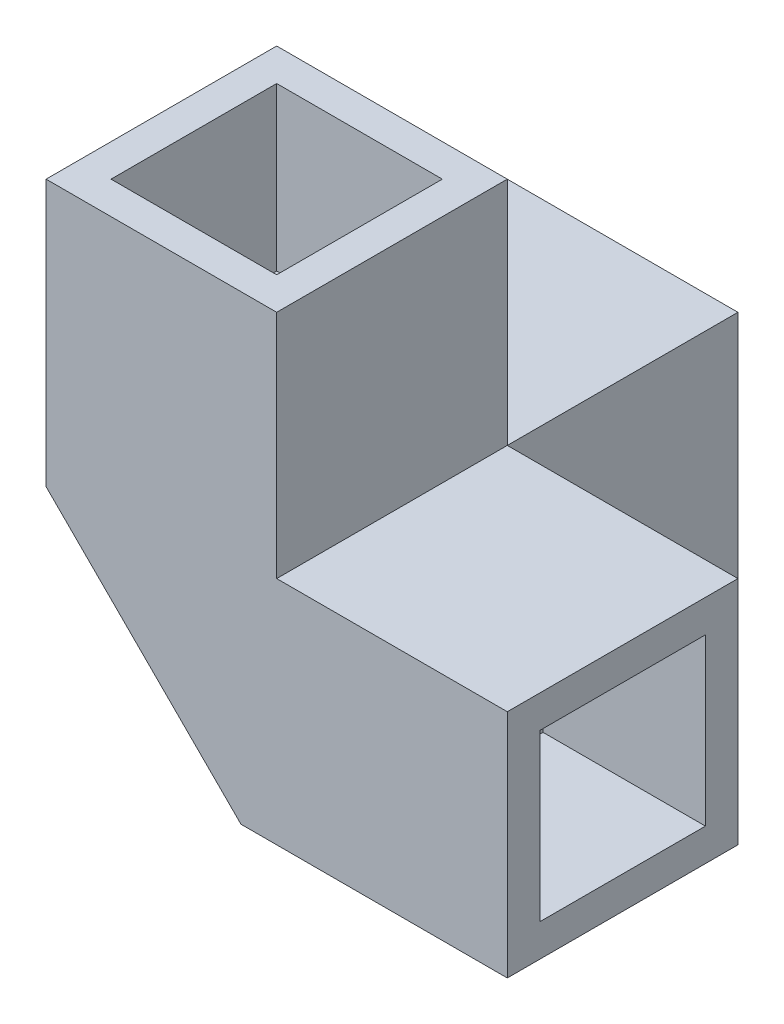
ISO-10303-21;
HEADER;
FILE_DESCRIPTION(('STEP AP214'),'2;1');
FILE_NAME('part.step','',(''),(''),'','','');
FILE_SCHEMA(('AUTOMOTIVE_DESIGN { 1 0 10303 214 1 1 1 1 }'));
ENDSEC;
DATA;
#1=APPLICATION_CONTEXT('core data for automotive mechanical design processes');
#2=APPLICATION_PROTOCOL_DEFINITION('international standard','automotive_design',2000,#1);
#3=PRODUCT_CONTEXT('',#1,'mechanical');
#4=PRODUCT('Part','Part','',(#3));
#5=PRODUCT_RELATED_PRODUCT_CATEGORY('part','',(#4));
#6=PRODUCT_DEFINITION_FORMATION('','',#4);
#7=PRODUCT_DEFINITION_CONTEXT('part definition',#1,'design');
#8=PRODUCT_DEFINITION('design','',#6,#7);
#9=PRODUCT_DEFINITION_SHAPE('','',#8);
#10=(LENGTH_UNIT() NAMED_UNIT(*) SI_UNIT(.MILLI.,.METRE.));
#11=(NAMED_UNIT(*) PLANE_ANGLE_UNIT() SI_UNIT($,.RADIAN.));
#12=(NAMED_UNIT(*) SI_UNIT($,.STERADIAN.) SOLID_ANGLE_UNIT());
#13=UNCERTAINTY_MEASURE_WITH_UNIT(LENGTH_MEASURE(1.E-05),#10,'distance_accuracy_value','');
#14=(GEOMETRIC_REPRESENTATION_CONTEXT(3) GLOBAL_UNCERTAINTY_ASSIGNED_CONTEXT((#13)) GLOBAL_UNIT_ASSIGNED_CONTEXT((#10,
#11,#12)) REPRESENTATION_CONTEXT('',''));
#15=CARTESIAN_POINT('',(0.,0.,0.));
#16=DIRECTION('',(0.,0.,1.));
#17=DIRECTION('',(1.,0.,0.));
#18=AXIS2_PLACEMENT_3D('',#15,#16,#17);
#19=CARTESIAN_POINT('',(0.,0.,0.));
#20=DIRECTION('',(0.,-1.,0.));
#21=DIRECTION('',(0.,0.,-1.));
#22=AXIS2_PLACEMENT_3D('',#19,#20,#21);
#23=PLANE('',#22);
#24=DIRECTION('',(1.,0.,0.));
#25=VECTOR('',#24,1.);
#26=CARTESIAN_POINT('',(53.25,0.,17.75));
#27=LINE('',#26,#25);
#28=CARTESIAN_POINT('',(12.25,0.,17.75));
#29=VERTEX_POINT('',#28);
#30=CARTESIAN_POINT('',(53.25,0.,17.75));
#31=VERTEX_POINT('',#30);
#32=EDGE_CURVE('E195',#29,#31,#27,.T.);
#33=ORIENTED_EDGE('',*,*,#32,.F.);
#34=DIRECTION('',(-0.707106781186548,0.,-0.707106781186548));
#35=VECTOR('',#34,1.);
#36=CARTESIAN_POINT('',(-2.75,0.,2.75));
#37=LINE('',#36,#35);
#38=CARTESIAN_POINT('',(-17.75,0.,-12.25));
#39=VERTEX_POINT('',#38);
#40=EDGE_CURVE('E11',#29,#39,#37,.T.);
#41=ORIENTED_EDGE('',*,*,#40,.T.);
#42=DIRECTION('',(0.,0.,1.));
#43=VECTOR('',#42,1.);
#44=CARTESIAN_POINT('',(-17.75,0.,17.75));
#45=LINE('',#44,#43);
#46=CARTESIAN_POINT('',(-17.75,0.,-53.25));
#47=VERTEX_POINT('',#46);
#48=EDGE_CURVE('E204',#47,#39,#45,.T.);
#49=ORIENTED_EDGE('',*,*,#48,.F.);
#50=DIRECTION('',(-1.,0.,0.));
#51=VECTOR('',#50,1.);
#52=CARTESIAN_POINT('',(-17.75,0.,-53.25));
#53=LINE('',#52,#51);
#54=CARTESIAN_POINT('',(17.75,0.,-53.25));
#55=VERTEX_POINT('',#54);
#56=EDGE_CURVE('E210',#55,#47,#53,.T.);
#57=ORIENTED_EDGE('',*,*,#56,.F.);
#58=DIRECTION('',(0.,0.,-1.));
#59=VECTOR('',#58,1.);
#60=CARTESIAN_POINT('',(17.75,0.,-53.25));
#61=LINE('',#60,#59);
#62=CARTESIAN_POINT('',(17.75,0.,-17.75));
#63=VERTEX_POINT('',#62);
#64=EDGE_CURVE('E265',#63,#55,#61,.T.);
#65=ORIENTED_EDGE('',*,*,#64,.F.);
#66=DIRECTION('',(-1.,0.,0.));
#67=VECTOR('',#66,1.);
#68=CARTESIAN_POINT('',(17.75,0.,-17.75));
#69=LINE('',#68,#67);
#70=CARTESIAN_POINT('',(53.25,0.,-17.75));
#71=VERTEX_POINT('',#70);
#72=EDGE_CURVE('E261',#71,#63,#69,.T.);
#73=ORIENTED_EDGE('',*,*,#72,.F.);
#74=DIRECTION('',(0.,0.,-1.));
#75=VECTOR('',#74,1.);
#76=CARTESIAN_POINT('',(53.25,0.,-17.75));
#77=LINE('',#76,#75);
#78=EDGE_CURVE('E202',#31,#71,#77,.T.);
#79=ORIENTED_EDGE('',*,*,#78,.F.);
#80=EDGE_LOOP('',(#33,#41,#49,#57,#65,#73,#79));
#81=FACE_BOUND('',#80,.T.);
#82=ADVANCED_FACE('F43',(#81),#23,.T.);
#83=CARTESIAN_POINT('',(0.,35.5,0.));
#84=DIRECTION('',(0.,-1.,0.));
#85=DIRECTION('',(0.,0.,-1.));
#86=AXIS2_PLACEMENT_3D('',#83,#84,#85);
#87=PLANE('',#86);
#88=DIRECTION('',(0.,0.,-1.));
#89=VECTOR('',#88,1.);
#90=CARTESIAN_POINT('',(17.75,35.5,17.75));
#91=LINE('',#90,#89);
#92=CARTESIAN_POINT('',(17.75,35.5,17.75));
#93=VERTEX_POINT('',#92);
#94=CARTESIAN_POINT('',(17.75,35.5,-17.75));
#95=VERTEX_POINT('',#94);
#96=EDGE_CURVE('E294',#93,#95,#91,.T.);
#97=ORIENTED_EDGE('',*,*,#96,.F.);
#98=DIRECTION('',(1.,0.,0.));
#99=VECTOR('',#98,1.);
#100=CARTESIAN_POINT('',(-17.75,35.5,17.75));
#101=LINE('',#100,#99);
#102=CARTESIAN_POINT('',(53.25,35.5,17.75));
#103=VERTEX_POINT('',#102);
#104=EDGE_CURVE('E239',#93,#103,#101,.T.);
#105=ORIENTED_EDGE('',*,*,#104,.T.);
#106=DIRECTION('',(0.,0.,-1.));
#107=VECTOR('',#106,1.);
#108=CARTESIAN_POINT('',(53.25,35.5,-17.75));
#109=LINE('',#108,#107);
#110=CARTESIAN_POINT('',(53.25,35.5,-17.75));
#111=VERTEX_POINT('',#110);
#112=EDGE_CURVE('E219',#103,#111,#109,.T.);
#113=ORIENTED_EDGE('',*,*,#112,.T.);
#114=DIRECTION('',(-1.,0.,0.));
#115=VECTOR('',#114,1.);
#116=CARTESIAN_POINT('',(17.75,35.5,-17.75));
#117=LINE('',#116,#115);
#118=EDGE_CURVE('E208',#111,#95,#117,.T.);
#119=ORIENTED_EDGE('',*,*,#118,.T.);
#120=EDGE_LOOP('',(#97,#105,#113,#119));
#121=FACE_BOUND('',#120,.T.);
#122=ADVANCED_FACE('F475',(#121),#87,.F.);
#123=DIRECTION('',(-1.,0.,0.));
#124=VECTOR('',#123,1.);
#125=CARTESIAN_POINT('',(-17.75,35.5,-17.75));
#126=LINE('',#125,#124);
#127=CARTESIAN_POINT('',(-17.75,35.5,-17.75));
#128=VERTEX_POINT('',#127);
#129=EDGE_CURVE('E285',#95,#128,#126,.T.);
#130=ORIENTED_EDGE('',*,*,#129,.F.);
#131=DIRECTION('',(0.,0.,-1.));
#132=VECTOR('',#131,1.);
#133=CARTESIAN_POINT('',(17.75,35.5,-53.25));
#134=LINE('',#133,#132);
#135=CARTESIAN_POINT('',(17.75,35.5,-53.25));
#136=VERTEX_POINT('',#135);
#137=EDGE_CURVE('E248',#95,#136,#134,.T.);
#138=ORIENTED_EDGE('',*,*,#137,.T.);
#139=DIRECTION('',(-1.,0.,0.));
#140=VECTOR('',#139,1.);
#141=CARTESIAN_POINT('',(-17.75,35.5,-53.25));
#142=LINE('',#141,#140);
#143=CARTESIAN_POINT('',(-17.75,35.5,-53.25));
#144=VERTEX_POINT('',#143);
#145=EDGE_CURVE('E245',#136,#144,#142,.T.);
#146=ORIENTED_EDGE('',*,*,#145,.T.);
#147=DIRECTION('',(0.,0.,1.));
#148=VECTOR('',#147,1.);
#149=CARTESIAN_POINT('',(-17.75,35.5,-17.75));
#150=LINE('',#149,#148);
#151=EDGE_CURVE('E242',#144,#128,#150,.T.);
#152=ORIENTED_EDGE('',*,*,#151,.T.);
#153=EDGE_LOOP('',(#130,#138,#146,#152));
#154=FACE_BOUND('',#153,.T.);
#155=ADVANCED_FACE('F284',(#154),#87,.F.);
#156=CARTESIAN_POINT('',(17.75,35.5,-17.75));
#157=DIRECTION('',(0.,0.,1.));
#158=DIRECTION('',(1.,0.,0.));
#159=AXIS2_PLACEMENT_3D('',#156,#157,#158);
#160=PLANE('',#159);
#161=ORIENTED_EDGE('',*,*,#72,.T.);
#162=DIRECTION('',(0.,-1.,0.));
#163=VECTOR('',#162,1.);
#164=CARTESIAN_POINT('',(17.75,35.5,-17.75));
#165=LINE('',#164,#163);
#166=EDGE_CURVE('E232',#95,#63,#165,.T.);
#167=ORIENTED_EDGE('',*,*,#166,.F.);
#168=ORIENTED_EDGE('',*,*,#118,.F.);
#169=DIRECTION('',(0.,-1.,0.));
#170=VECTOR('',#169,1.);
#171=CARTESIAN_POINT('',(53.25,35.5,-17.75));
#172=LINE('',#171,#170);
#173=EDGE_CURVE('E214',#111,#71,#172,.T.);
#174=ORIENTED_EDGE('',*,*,#173,.T.);
#175=EDGE_LOOP('',(#161,#167,#168,#174));
#176=FACE_BOUND('',#175,.T.);
#177=ADVANCED_FACE('F45',(#176),#160,.F.);
#178=CARTESIAN_POINT('',(17.75,35.5,-53.25));
#179=DIRECTION('',(-1.,0.,0.));
#180=DIRECTION('',(0.,0.,1.));
#181=AXIS2_PLACEMENT_3D('',#178,#179,#180);
#182=PLANE('',#181);
#183=ORIENTED_EDGE('',*,*,#64,.T.);
#184=DIRECTION('',(0.,-1.,0.));
#185=VECTOR('',#184,1.);
#186=CARTESIAN_POINT('',(17.75,35.5,-53.25));
#187=LINE('',#186,#185);
#188=EDGE_CURVE('E228',#136,#55,#187,.T.);
#189=ORIENTED_EDGE('',*,*,#188,.F.);
#190=ORIENTED_EDGE('',*,*,#137,.F.);
#191=ORIENTED_EDGE('',*,*,#166,.T.);
#192=EDGE_LOOP('',(#183,#189,#190,#191));
#193=FACE_BOUND('',#192,.T.);
#194=ADVANCED_FACE('F466',(#193),#182,.F.);
#195=CARTESIAN_POINT('',(-17.75,35.5,-53.25));
#196=DIRECTION('',(0.,0.,1.));
#197=DIRECTION('',(1.,0.,0.));
#198=AXIS2_PLACEMENT_3D('',#195,#196,#197);
#199=PLANE('',#198);
#200=DIRECTION('',(-1.,0.,0.));
#201=VECTOR('',#200,1.);
#202=CARTESIAN_POINT('',(12.75,5.,-53.25));
#203=LINE('',#202,#201);
#204=CARTESIAN_POINT('',(12.75,5.,-53.25));
#205=VERTEX_POINT('',#204);
#206=CARTESIAN_POINT('',(-12.75,5.,-53.25));
#207=VERTEX_POINT('',#206);
#208=EDGE_CURVE('E429',#205,#207,#203,.T.);
#209=ORIENTED_EDGE('',*,*,#208,.F.);
#210=DIRECTION('',(0.,-1.,0.));
#211=VECTOR('',#210,1.);
#212=CARTESIAN_POINT('',(12.75,30.5,-53.25));
#213=LINE('',#212,#211);
#214=CARTESIAN_POINT('',(12.75,30.5,-53.25));
#215=VERTEX_POINT('',#214);
#216=EDGE_CURVE('E66',#215,#205,#213,.T.);
#217=ORIENTED_EDGE('',*,*,#216,.F.);
#218=DIRECTION('',(1.,0.,0.));
#219=VECTOR('',#218,1.);
#220=CARTESIAN_POINT('',(-12.75,30.5,-53.25));
#221=LINE('',#220,#219);
#222=CARTESIAN_POINT('',(-12.75,30.5,-53.25));
#223=VERTEX_POINT('',#222);
#224=EDGE_CURVE('E420',#223,#215,#221,.T.);
#225=ORIENTED_EDGE('',*,*,#224,.F.);
#226=DIRECTION('',(0.,1.,0.));
#227=VECTOR('',#226,1.);
#228=CARTESIAN_POINT('',(-12.75,5.,-53.25));
#229=LINE('',#228,#227);
#230=EDGE_CURVE('E425',#207,#223,#229,.T.);
#231=ORIENTED_EDGE('',*,*,#230,.F.);
#232=EDGE_LOOP('',(#209,#217,#225,#231));
#233=FACE_BOUND('',#232,.T.);
#234=ORIENTED_EDGE('',*,*,#56,.T.);
#235=DIRECTION('',(0.,-1.,0.));
#236=VECTOR('',#235,1.);
#237=CARTESIAN_POINT('',(-17.75,35.5,-53.25));
#238=LINE('',#237,#236);
#239=EDGE_CURVE('E224',#144,#47,#238,.T.);
#240=ORIENTED_EDGE('',*,*,#239,.F.);
#241=ORIENTED_EDGE('',*,*,#145,.F.);
#242=ORIENTED_EDGE('',*,*,#188,.T.);
#243=EDGE_LOOP('',(#234,#240,#241,#242));
#244=FACE_BOUND('',#243,.T.);
#245=ADVANCED_FACE('F272',(#233,#244),#199,.F.);
#246=CARTESIAN_POINT('',(-17.75,35.5,17.75));
#247=DIRECTION('',(1.,0.,0.));
#248=DIRECTION('',(0.,0.,-1.));
#249=AXIS2_PLACEMENT_3D('',#246,#247,#248);
#250=PLANE('',#249);
#251=DIRECTION('',(0.,-0.707106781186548,-0.707106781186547));
#252=VECTOR('',#251,1.);
#253=CARTESIAN_POINT('',(-17.75,32.75,20.5));
#254=LINE('',#253,#252);
#255=CARTESIAN_POINT('',(-17.75,30.,17.75));
#256=VERTEX_POINT('',#255);
#257=EDGE_CURVE('E59',#256,#39,#254,.T.);
#258=ORIENTED_EDGE('',*,*,#257,.F.);
#259=DIRECTION('',(0.,-1.,0.));
#260=VECTOR('',#259,1.);
#261=CARTESIAN_POINT('',(-17.75,35.5,17.75));
#262=LINE('',#261,#260);
#263=CARTESIAN_POINT('',(-17.75,71.,17.75));
#264=VERTEX_POINT('',#263);
#265=EDGE_CURVE('E198',#264,#256,#262,.T.);
#266=ORIENTED_EDGE('',*,*,#265,.F.);
#267=DIRECTION('',(0.,0.,1.));
#268=VECTOR('',#267,1.);
#269=CARTESIAN_POINT('',(-17.75,71.,17.75));
#270=LINE('',#269,#268);
#271=CARTESIAN_POINT('',(-17.75,71.,-17.75));
#272=VERTEX_POINT('',#271);
#273=EDGE_CURVE('E313',#272,#264,#270,.T.);
#274=ORIENTED_EDGE('',*,*,#273,.F.);
#275=DIRECTION('',(0.,-1.,0.));
#276=VECTOR('',#275,1.);
#277=CARTESIAN_POINT('',(-17.75,71.,-17.75));
#278=LINE('',#277,#276);
#279=EDGE_CURVE('E281',#272,#128,#278,.T.);
#280=ORIENTED_EDGE('',*,*,#279,.T.);
#281=ORIENTED_EDGE('',*,*,#151,.F.);
#282=ORIENTED_EDGE('',*,*,#239,.T.);
#283=ORIENTED_EDGE('',*,*,#48,.T.);
#284=EDGE_LOOP('',(#258,#266,#274,#280,#281,#282,#283));
#285=FACE_BOUND('',#284,.T.);
#286=ADVANCED_FACE('F277',(#285),#250,.F.);
#287=CARTESIAN_POINT('',(53.25,35.5,17.75));
#288=DIRECTION('',(0.,0.,-1.));
#289=DIRECTION('',(-1.,0.,0.));
#290=AXIS2_PLACEMENT_3D('',#287,#288,#289);
#291=PLANE('',#290);
#292=DIRECTION('',(-0.707106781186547,0.707106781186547,0.));
#293=VECTOR('',#292,1.);
#294=CARTESIAN_POINT('',(15.,-2.74999999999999,17.75));
#295=LINE('',#294,#293);
#296=EDGE_CURVE('E52',#29,#256,#295,.T.);
#297=ORIENTED_EDGE('',*,*,#296,.F.);
#298=ORIENTED_EDGE('',*,*,#32,.T.);
#299=DIRECTION('',(0.,-1.,0.));
#300=VECTOR('',#299,1.);
#301=CARTESIAN_POINT('',(53.25,35.5,17.75));
#302=LINE('',#301,#300);
#303=EDGE_CURVE('E218',#103,#31,#302,.T.);
#304=ORIENTED_EDGE('',*,*,#303,.F.);
#305=ORIENTED_EDGE('',*,*,#104,.F.);
#306=DIRECTION('',(0.,-1.,0.));
#307=VECTOR('',#306,1.);
#308=CARTESIAN_POINT('',(17.75,71.,17.75));
#309=LINE('',#308,#307);
#310=CARTESIAN_POINT('',(17.75,71.,17.75));
#311=VERTEX_POINT('',#310);
#312=EDGE_CURVE('E305',#311,#93,#309,.T.);
#313=ORIENTED_EDGE('',*,*,#312,.F.);
#314=DIRECTION('',(1.,0.,0.));
#315=VECTOR('',#314,1.);
#316=CARTESIAN_POINT('',(-17.75,71.,17.75));
#317=LINE('',#316,#315);
#318=EDGE_CURVE('E308',#264,#311,#317,.T.);
#319=ORIENTED_EDGE('',*,*,#318,.F.);
#320=ORIENTED_EDGE('',*,*,#265,.T.);
#321=EDGE_LOOP('',(#297,#298,#304,#305,#313,#319,#320));
#322=FACE_BOUND('',#321,.T.);
#323=ADVANCED_FACE('F193',(#322),#291,.F.);
#324=CARTESIAN_POINT('',(53.25,35.5,-17.75));
#325=DIRECTION('',(-1.,0.,0.));
#326=DIRECTION('',(0.,0.,1.));
#327=AXIS2_PLACEMENT_3D('',#324,#325,#326);
#328=PLANE('',#327);
#329=DIRECTION('',(0.,0.,-1.));
#330=VECTOR('',#329,1.);
#331=CARTESIAN_POINT('',(53.25,5.,12.75));
#332=LINE('',#331,#330);
#333=CARTESIAN_POINT('',(53.25,5.,12.75));
#334=VERTEX_POINT('',#333);
#335=CARTESIAN_POINT('',(53.25,5.,-12.75));
#336=VERTEX_POINT('',#335);
#337=EDGE_CURVE('E342',#334,#336,#332,.T.);
#338=ORIENTED_EDGE('',*,*,#337,.F.);
#339=DIRECTION('',(0.,-1.,0.));
#340=VECTOR('',#339,1.);
#341=CARTESIAN_POINT('',(53.25,30.5,12.75));
#342=LINE('',#341,#340);
#343=CARTESIAN_POINT('',(53.25,30.5,12.75));
#344=VERTEX_POINT('',#343);
#345=EDGE_CURVE('E346',#344,#334,#342,.T.);
#346=ORIENTED_EDGE('',*,*,#345,.F.);
#347=DIRECTION('',(0.,0.,1.));
#348=VECTOR('',#347,1.);
#349=CARTESIAN_POINT('',(53.25,30.5,-12.75));
#350=LINE('',#349,#348);
#351=CARTESIAN_POINT('',(53.25,30.5,-12.75));
#352=VERTEX_POINT('',#351);
#353=EDGE_CURVE('E333',#352,#344,#350,.T.);
#354=ORIENTED_EDGE('',*,*,#353,.F.);
#355=DIRECTION('',(0.,1.,0.));
#356=VECTOR('',#355,1.);
#357=CARTESIAN_POINT('',(53.25,5.,-12.75));
#358=LINE('',#357,#356);
#359=EDGE_CURVE('E338',#336,#352,#358,.T.);
#360=ORIENTED_EDGE('',*,*,#359,.F.);
#361=EDGE_LOOP('',(#338,#346,#354,#360));
#362=FACE_BOUND('',#361,.T.);
#363=ORIENTED_EDGE('',*,*,#78,.T.);
#364=ORIENTED_EDGE('',*,*,#173,.F.);
#365=ORIENTED_EDGE('',*,*,#112,.F.);
#366=ORIENTED_EDGE('',*,*,#303,.T.);
#367=EDGE_LOOP('',(#363,#364,#365,#366));
#368=FACE_BOUND('',#367,.T.);
#369=ADVANCED_FACE('F483',(#362,#368),#328,.F.);
#370=CARTESIAN_POINT('',(17.75,71.,17.75));
#371=DIRECTION('',(-1.,0.,0.));
#372=DIRECTION('',(0.,0.,1.));
#373=AXIS2_PLACEMENT_3D('',#370,#371,#372);
#374=PLANE('',#373);
#375=ORIENTED_EDGE('',*,*,#96,.T.);
#376=DIRECTION('',(0.,-1.,0.));
#377=VECTOR('',#376,1.);
#378=CARTESIAN_POINT('',(17.75,71.,-17.75));
#379=LINE('',#378,#377);
#380=CARTESIAN_POINT('',(17.75,71.,-17.75));
#381=VERTEX_POINT('',#380);
#382=EDGE_CURVE('E258',#381,#95,#379,.T.);
#383=ORIENTED_EDGE('',*,*,#382,.F.);
#384=DIRECTION('',(0.,0.,-1.));
#385=VECTOR('',#384,1.);
#386=CARTESIAN_POINT('',(17.75,71.,17.75));
#387=LINE('',#386,#385);
#388=EDGE_CURVE('E293',#311,#381,#387,.T.);
#389=ORIENTED_EDGE('',*,*,#388,.F.);
#390=ORIENTED_EDGE('',*,*,#312,.T.);
#391=EDGE_LOOP('',(#375,#383,#389,#390));
#392=FACE_BOUND('',#391,.T.);
#393=ADVANCED_FACE('F486',(#392),#374,.F.);
#394=CARTESIAN_POINT('',(-17.75,71.,-17.75));
#395=DIRECTION('',(0.,0.,1.));
#396=DIRECTION('',(1.,0.,0.));
#397=AXIS2_PLACEMENT_3D('',#394,#395,#396);
#398=PLANE('',#397);
#399=ORIENTED_EDGE('',*,*,#129,.T.);
#400=ORIENTED_EDGE('',*,*,#279,.F.);
#401=DIRECTION('',(-1.,0.,0.));
#402=VECTOR('',#401,1.);
#403=CARTESIAN_POINT('',(-17.75,71.,-17.75));
#404=LINE('',#403,#402);
#405=EDGE_CURVE('E299',#381,#272,#404,.T.);
#406=ORIENTED_EDGE('',*,*,#405,.F.);
#407=ORIENTED_EDGE('',*,*,#382,.T.);
#408=EDGE_LOOP('',(#399,#400,#406,#407));
#409=FACE_BOUND('',#408,.T.);
#410=ADVANCED_FACE('F289',(#409),#398,.F.);
#411=CARTESIAN_POINT('',(0.,71.,0.));
#412=DIRECTION('',(0.,-1.,0.));
#413=DIRECTION('',(0.,0.,-1.));
#414=AXIS2_PLACEMENT_3D('',#411,#412,#413);
#415=PLANE('',#414);
#416=DIRECTION('',(0.,0.,-1.));
#417=VECTOR('',#416,1.);
#418=CARTESIAN_POINT('',(12.75,71.,12.75));
#419=LINE('',#418,#417);
#420=CARTESIAN_POINT('',(12.75,71.,12.75));
#421=VERTEX_POINT('',#420);
#422=CARTESIAN_POINT('',(12.75,71.,-12.75));
#423=VERTEX_POINT('',#422);
#424=EDGE_CURVE('E386',#421,#423,#419,.T.);
#425=ORIENTED_EDGE('',*,*,#424,.F.);
#426=DIRECTION('',(1.,0.,0.));
#427=VECTOR('',#426,1.);
#428=CARTESIAN_POINT('',(-12.75,71.,12.75));
#429=LINE('',#428,#427);
#430=CARTESIAN_POINT('',(-12.75,71.,12.75));
#431=VERTEX_POINT('',#430);
#432=EDGE_CURVE('E390',#431,#421,#429,.T.);
#433=ORIENTED_EDGE('',*,*,#432,.F.);
#434=DIRECTION('',(0.,0.,1.));
#435=VECTOR('',#434,1.);
#436=CARTESIAN_POINT('',(-12.75,71.,-12.75));
#437=LINE('',#436,#435);
#438=CARTESIAN_POINT('',(-12.75,71.,-12.75));
#439=VERTEX_POINT('',#438);
#440=EDGE_CURVE('E377',#439,#431,#437,.T.);
#441=ORIENTED_EDGE('',*,*,#440,.F.);
#442=DIRECTION('',(-1.,0.,0.));
#443=VECTOR('',#442,1.);
#444=CARTESIAN_POINT('',(12.75,71.,-12.75));
#445=LINE('',#444,#443);
#446=EDGE_CURVE('E382',#423,#439,#445,.T.);
#447=ORIENTED_EDGE('',*,*,#446,.F.);
#448=EDGE_LOOP('',(#425,#433,#441,#447));
#449=FACE_BOUND('',#448,.T.);
#450=ORIENTED_EDGE('',*,*,#388,.T.);
#451=ORIENTED_EDGE('',*,*,#405,.T.);
#452=ORIENTED_EDGE('',*,*,#273,.T.);
#453=ORIENTED_EDGE('',*,*,#318,.T.);
#454=EDGE_LOOP('',(#450,#451,#452,#453));
#455=FACE_BOUND('',#454,.T.);
#456=ADVANCED_FACE('F512',(#449,#455),#415,.F.);
#457=CARTESIAN_POINT('',(28.25,30.5,12.75));
#458=DIRECTION('',(0.,0.,1.));
#459=DIRECTION('',(1.,0.,0.));
#460=AXIS2_PLACEMENT_3D('',#457,#458,#459);
#461=PLANE('',#460);
#462=ORIENTED_EDGE('',*,*,#345,.T.);
#463=DIRECTION('',(1.,0.,0.));
#464=VECTOR('',#463,1.);
#465=CARTESIAN_POINT('',(28.25,5.,12.75));
#466=LINE('',#465,#464);
#467=CARTESIAN_POINT('',(28.25,5.,12.75));
#468=VERTEX_POINT('',#467);
#469=EDGE_CURVE('E320',#468,#334,#466,.T.);
#470=ORIENTED_EDGE('',*,*,#469,.F.);
#471=DIRECTION('',(0.,-1.,0.));
#472=VECTOR('',#471,1.);
#473=CARTESIAN_POINT('',(28.25,30.5,12.75));
#474=LINE('',#473,#472);
#475=CARTESIAN_POINT('',(28.25,30.5,12.75));
#476=VERTEX_POINT('',#475);
#477=EDGE_CURVE('E337',#476,#468,#474,.T.);
#478=ORIENTED_EDGE('',*,*,#477,.F.);
#479=DIRECTION('',(1.,0.,0.));
#480=VECTOR('',#479,1.);
#481=CARTESIAN_POINT('',(28.25,30.5,12.75));
#482=LINE('',#481,#480);
#483=EDGE_CURVE('E301',#476,#344,#482,.T.);
#484=ORIENTED_EDGE('',*,*,#483,.T.);
#485=EDGE_LOOP('',(#462,#470,#478,#484));
#486=FACE_BOUND('',#485,.T.);
#487=ADVANCED_FACE('F519',(#486),#461,.F.);
#488=CARTESIAN_POINT('',(28.25,30.5,-12.75));
#489=DIRECTION('',(0.,1.,0.));
#490=DIRECTION('',(0.,0.,1.));
#491=AXIS2_PLACEMENT_3D('',#488,#489,#490);
#492=PLANE('',#491);
#493=ORIENTED_EDGE('',*,*,#353,.T.);
#494=ORIENTED_EDGE('',*,*,#483,.F.);
#495=DIRECTION('',(0.,0.,1.));
#496=VECTOR('',#495,1.);
#497=CARTESIAN_POINT('',(28.25,30.5,-12.75));
#498=LINE('',#497,#496);
#499=CARTESIAN_POINT('',(28.25,30.5,-12.75));
#500=VERTEX_POINT('',#499);
#501=EDGE_CURVE('E325',#500,#476,#498,.T.);
#502=ORIENTED_EDGE('',*,*,#501,.F.);
#503=DIRECTION('',(1.,0.,0.));
#504=VECTOR('',#503,1.);
#505=CARTESIAN_POINT('',(28.25,30.5,-12.75));
#506=LINE('',#505,#504);
#507=EDGE_CURVE('E328',#500,#352,#506,.T.);
#508=ORIENTED_EDGE('',*,*,#507,.T.);
#509=EDGE_LOOP('',(#493,#494,#502,#508));
#510=FACE_BOUND('',#509,.T.);
#511=ADVANCED_FACE('F528',(#510),#492,.F.);
#512=CARTESIAN_POINT('',(28.25,5.,-12.75));
#513=DIRECTION('',(0.,0.,-1.));
#514=DIRECTION('',(-1.,0.,0.));
#515=AXIS2_PLACEMENT_3D('',#512,#513,#514);
#516=PLANE('',#515);
#517=ORIENTED_EDGE('',*,*,#359,.T.);
#518=ORIENTED_EDGE('',*,*,#507,.F.);
#519=DIRECTION('',(0.,1.,0.));
#520=VECTOR('',#519,1.);
#521=CARTESIAN_POINT('',(28.25,5.,-12.75));
#522=LINE('',#521,#520);
#523=CARTESIAN_POINT('',(28.25,5.,-12.75));
#524=VERTEX_POINT('',#523);
#525=EDGE_CURVE('E353',#524,#500,#522,.T.);
#526=ORIENTED_EDGE('',*,*,#525,.F.);
#527=DIRECTION('',(1.,0.,0.));
#528=VECTOR('',#527,1.);
#529=CARTESIAN_POINT('',(28.25,5.,-12.75));
#530=LINE('',#529,#528);
#531=EDGE_CURVE('E324',#524,#336,#530,.T.);
#532=ORIENTED_EDGE('',*,*,#531,.T.);
#533=EDGE_LOOP('',(#517,#518,#526,#532));
#534=FACE_BOUND('',#533,.T.);
#535=ADVANCED_FACE('F536',(#534),#516,.F.);
#536=CARTESIAN_POINT('',(28.25,5.,12.75));
#537=DIRECTION('',(0.,-1.,0.));
#538=DIRECTION('',(0.,0.,-1.));
#539=AXIS2_PLACEMENT_3D('',#536,#537,#538);
#540=PLANE('',#539);
#541=ORIENTED_EDGE('',*,*,#337,.T.);
#542=ORIENTED_EDGE('',*,*,#531,.F.);
#543=DIRECTION('',(0.,0.,-1.));
#544=VECTOR('',#543,1.);
#545=CARTESIAN_POINT('',(28.25,5.,12.75));
#546=LINE('',#545,#544);
#547=EDGE_CURVE('E357',#468,#524,#546,.T.);
#548=ORIENTED_EDGE('',*,*,#547,.F.);
#549=ORIENTED_EDGE('',*,*,#469,.T.);
#550=EDGE_LOOP('',(#541,#542,#548,#549));
#551=FACE_BOUND('',#550,.T.);
#552=ADVANCED_FACE('F544',(#551),#540,.F.);
#553=CARTESIAN_POINT('',(28.25,0.,0.));
#554=DIRECTION('',(1.,0.,0.));
#555=DIRECTION('',(0.,0.,-1.));
#556=AXIS2_PLACEMENT_3D('',#553,#554,#555);
#557=PLANE('',#556);
#558=ORIENTED_EDGE('',*,*,#477,.T.);
#559=ORIENTED_EDGE('',*,*,#547,.T.);
#560=ORIENTED_EDGE('',*,*,#525,.T.);
#561=ORIENTED_EDGE('',*,*,#501,.T.);
#562=EDGE_LOOP('',(#558,#559,#560,#561));
#563=FACE_BOUND('',#562,.T.);
#564=ADVANCED_FACE('F552',(#563),#557,.T.);
#565=CARTESIAN_POINT('',(-12.75,46.,12.75));
#566=DIRECTION('',(0.,0.,1.));
#567=DIRECTION('',(1.,0.,0.));
#568=AXIS2_PLACEMENT_3D('',#565,#566,#567);
#569=PLANE('',#568);
#570=ORIENTED_EDGE('',*,*,#432,.T.);
#571=DIRECTION('',(0.,1.,0.));
#572=VECTOR('',#571,1.);
#573=CARTESIAN_POINT('',(12.75,46.,12.75));
#574=LINE('',#573,#572);
#575=CARTESIAN_POINT('',(12.75,46.,12.75));
#576=VERTEX_POINT('',#575);
#577=EDGE_CURVE('E364',#576,#421,#574,.T.);
#578=ORIENTED_EDGE('',*,*,#577,.F.);
#579=DIRECTION('',(1.,0.,0.));
#580=VECTOR('',#579,1.);
#581=CARTESIAN_POINT('',(-12.75,46.,12.75));
#582=LINE('',#581,#580);
#583=CARTESIAN_POINT('',(-12.75,46.,12.75));
#584=VERTEX_POINT('',#583);
#585=EDGE_CURVE('E381',#584,#576,#582,.T.);
#586=ORIENTED_EDGE('',*,*,#585,.F.);
#587=DIRECTION('',(0.,1.,0.));
#588=VECTOR('',#587,1.);
#589=CARTESIAN_POINT('',(-12.75,46.,12.75));
#590=LINE('',#589,#588);
#591=EDGE_CURVE('E349',#584,#431,#590,.T.);
#592=ORIENTED_EDGE('',*,*,#591,.T.);
#593=EDGE_LOOP('',(#570,#578,#586,#592));
#594=FACE_BOUND('',#593,.T.);
#595=ADVANCED_FACE('F559',(#594),#569,.F.);
#596=CARTESIAN_POINT('',(-12.75,46.,-12.75));
#597=DIRECTION('',(-1.,0.,0.));
#598=DIRECTION('',(0.,0.,1.));
#599=AXIS2_PLACEMENT_3D('',#596,#597,#598);
#600=PLANE('',#599);
#601=ORIENTED_EDGE('',*,*,#440,.T.);
#602=ORIENTED_EDGE('',*,*,#591,.F.);
#603=DIRECTION('',(0.,0.,1.));
#604=VECTOR('',#603,1.);
#605=CARTESIAN_POINT('',(-12.75,46.,-12.75));
#606=LINE('',#605,#604);
#607=CARTESIAN_POINT('',(-12.75,46.,-12.75));
#608=VERTEX_POINT('',#607);
#609=EDGE_CURVE('E369',#608,#584,#606,.T.);
#610=ORIENTED_EDGE('',*,*,#609,.F.);
#611=DIRECTION('',(0.,1.,0.));
#612=VECTOR('',#611,1.);
#613=CARTESIAN_POINT('',(-12.75,46.,-12.75));
#614=LINE('',#613,#612);
#615=EDGE_CURVE('E372',#608,#439,#614,.T.);
#616=ORIENTED_EDGE('',*,*,#615,.T.);
#617=EDGE_LOOP('',(#601,#602,#610,#616));
#618=FACE_BOUND('',#617,.T.);
#619=ADVANCED_FACE('F566',(#618),#600,.F.);
#620=CARTESIAN_POINT('',(12.75,46.,-12.75));
#621=DIRECTION('',(0.,0.,-1.));
#622=DIRECTION('',(-1.,0.,0.));
#623=AXIS2_PLACEMENT_3D('',#620,#621,#622);
#624=PLANE('',#623);
#625=ORIENTED_EDGE('',*,*,#446,.T.);
#626=ORIENTED_EDGE('',*,*,#615,.F.);
#627=DIRECTION('',(-1.,0.,0.));
#628=VECTOR('',#627,1.);
#629=CARTESIAN_POINT('',(12.75,46.,-12.75));
#630=LINE('',#629,#628);
#631=CARTESIAN_POINT('',(12.75,46.,-12.75));
#632=VERTEX_POINT('',#631);
#633=EDGE_CURVE('E397',#632,#608,#630,.T.);
#634=ORIENTED_EDGE('',*,*,#633,.F.);
#635=DIRECTION('',(0.,1.,0.));
#636=VECTOR('',#635,1.);
#637=CARTESIAN_POINT('',(12.75,46.,-12.75));
#638=LINE('',#637,#636);
#639=EDGE_CURVE('E368',#632,#423,#638,.T.);
#640=ORIENTED_EDGE('',*,*,#639,.T.);
#641=EDGE_LOOP('',(#625,#626,#634,#640));
#642=FACE_BOUND('',#641,.T.);
#643=ADVANCED_FACE('F574',(#642),#624,.F.);
#644=CARTESIAN_POINT('',(12.75,46.,12.75));
#645=DIRECTION('',(1.,0.,0.));
#646=DIRECTION('',(0.,0.,-1.));
#647=AXIS2_PLACEMENT_3D('',#644,#645,#646);
#648=PLANE('',#647);
#649=ORIENTED_EDGE('',*,*,#424,.T.);
#650=ORIENTED_EDGE('',*,*,#639,.F.);
#651=DIRECTION('',(0.,0.,-1.));
#652=VECTOR('',#651,1.);
#653=CARTESIAN_POINT('',(12.75,46.,12.75));
#654=LINE('',#653,#652);
#655=EDGE_CURVE('E401',#576,#632,#654,.T.);
#656=ORIENTED_EDGE('',*,*,#655,.F.);
#657=ORIENTED_EDGE('',*,*,#577,.T.);
#658=EDGE_LOOP('',(#649,#650,#656,#657));
#659=FACE_BOUND('',#658,.T.);
#660=ADVANCED_FACE('F582',(#659),#648,.F.);
#661=CARTESIAN_POINT('',(0.,46.,0.));
#662=DIRECTION('',(0.,1.,0.));
#663=DIRECTION('',(0.,0.,1.));
#664=AXIS2_PLACEMENT_3D('',#661,#662,#663);
#665=PLANE('',#664);
#666=ORIENTED_EDGE('',*,*,#585,.T.);
#667=ORIENTED_EDGE('',*,*,#655,.T.);
#668=ORIENTED_EDGE('',*,*,#633,.T.);
#669=ORIENTED_EDGE('',*,*,#609,.T.);
#670=EDGE_LOOP('',(#666,#667,#668,#669));
#671=FACE_BOUND('',#670,.T.);
#672=ADVANCED_FACE('F590',(#671),#665,.T.);
#673=CARTESIAN_POINT('',(12.75,30.5,-28.25));
#674=DIRECTION('',(1.,0.,0.));
#675=DIRECTION('',(0.,0.,-1.));
#676=AXIS2_PLACEMENT_3D('',#673,#674,#675);
#677=PLANE('',#676);
#678=ORIENTED_EDGE('',*,*,#216,.T.);
#679=DIRECTION('',(0.,0.,-1.));
#680=VECTOR('',#679,1.);
#681=CARTESIAN_POINT('',(12.75,5.,-28.25));
#682=LINE('',#681,#680);
#683=CARTESIAN_POINT('',(12.75,5.,-28.25));
#684=VERTEX_POINT('',#683);
#685=EDGE_CURVE('E408',#684,#205,#682,.T.);
#686=ORIENTED_EDGE('',*,*,#685,.F.);
#687=DIRECTION('',(0.,-1.,0.));
#688=VECTOR('',#687,1.);
#689=CARTESIAN_POINT('',(12.75,30.5,-28.25));
#690=LINE('',#689,#688);
#691=CARTESIAN_POINT('',(12.75,30.5,-28.25));
#692=VERTEX_POINT('',#691);
#693=EDGE_CURVE('E424',#692,#684,#690,.T.);
#694=ORIENTED_EDGE('',*,*,#693,.F.);
#695=DIRECTION('',(0.,0.,-1.));
#696=VECTOR('',#695,1.);
#697=CARTESIAN_POINT('',(12.75,30.5,-28.25));
#698=LINE('',#697,#696);
#699=EDGE_CURVE('E393',#692,#215,#698,.T.);
#700=ORIENTED_EDGE('',*,*,#699,.T.);
#701=EDGE_LOOP('',(#678,#686,#694,#700));
#702=FACE_BOUND('',#701,.T.);
#703=ADVANCED_FACE('F453',(#702),#677,.F.);
#704=CARTESIAN_POINT('',(-12.75,30.5,-28.25));
#705=DIRECTION('',(0.,1.,0.));
#706=DIRECTION('',(0.,0.,1.));
#707=AXIS2_PLACEMENT_3D('',#704,#705,#706);
#708=PLANE('',#707);
#709=ORIENTED_EDGE('',*,*,#224,.T.);
#710=ORIENTED_EDGE('',*,*,#699,.F.);
#711=DIRECTION('',(1.,0.,0.));
#712=VECTOR('',#711,1.);
#713=CARTESIAN_POINT('',(-12.75,30.5,-28.25));
#714=LINE('',#713,#712);
#715=CARTESIAN_POINT('',(-12.75,30.5,-28.25));
#716=VERTEX_POINT('',#715);
#717=EDGE_CURVE('E412',#716,#692,#714,.T.);
#718=ORIENTED_EDGE('',*,*,#717,.F.);
#719=DIRECTION('',(0.,0.,-1.));
#720=VECTOR('',#719,1.);
#721=CARTESIAN_POINT('',(-12.75,30.5,-28.25));
#722=LINE('',#721,#720);
#723=EDGE_CURVE('E415',#716,#223,#722,.T.);
#724=ORIENTED_EDGE('',*,*,#723,.T.);
#725=EDGE_LOOP('',(#709,#710,#718,#724));
#726=FACE_BOUND('',#725,.T.);
#727=ADVANCED_FACE('F462',(#726),#708,.F.);
#728=CARTESIAN_POINT('',(-12.75,5.,-28.25));
#729=DIRECTION('',(-1.,0.,0.));
#730=DIRECTION('',(0.,0.,1.));
#731=AXIS2_PLACEMENT_3D('',#728,#729,#730);
#732=PLANE('',#731);
#733=ORIENTED_EDGE('',*,*,#230,.T.);
#734=ORIENTED_EDGE('',*,*,#723,.F.);
#735=DIRECTION('',(0.,1.,0.));
#736=VECTOR('',#735,1.);
#737=CARTESIAN_POINT('',(-12.75,5.,-28.25));
#738=LINE('',#737,#736);
#739=CARTESIAN_POINT('',(-12.75,5.,-28.25));
#740=VERTEX_POINT('',#739);
#741=EDGE_CURVE('E438',#740,#716,#738,.T.);
#742=ORIENTED_EDGE('',*,*,#741,.F.);
#743=DIRECTION('',(0.,0.,-1.));
#744=VECTOR('',#743,1.);
#745=CARTESIAN_POINT('',(-12.75,5.,-28.25));
#746=LINE('',#745,#744);
#747=EDGE_CURVE('E411',#740,#207,#746,.T.);
#748=ORIENTED_EDGE('',*,*,#747,.T.);
#749=EDGE_LOOP('',(#733,#734,#742,#748));
#750=FACE_BOUND('',#749,.T.);
#751=ADVANCED_FACE('F460',(#750),#732,.F.);
#752=CARTESIAN_POINT('',(12.75,5.,-28.25));
#753=DIRECTION('',(0.,-1.,0.));
#754=DIRECTION('',(0.,0.,-1.));
#755=AXIS2_PLACEMENT_3D('',#752,#753,#754);
#756=PLANE('',#755);
#757=ORIENTED_EDGE('',*,*,#208,.T.);
#758=ORIENTED_EDGE('',*,*,#747,.F.);
#759=DIRECTION('',(-1.,0.,0.));
#760=VECTOR('',#759,1.);
#761=CARTESIAN_POINT('',(12.75,5.,-28.25));
#762=LINE('',#761,#760);
#763=EDGE_CURVE('E442',#684,#740,#762,.T.);
#764=ORIENTED_EDGE('',*,*,#763,.F.);
#765=ORIENTED_EDGE('',*,*,#685,.T.);
#766=EDGE_LOOP('',(#757,#758,#764,#765));
#767=FACE_BOUND('',#766,.T.);
#768=ADVANCED_FACE('F456',(#767),#756,.F.);
#769=CARTESIAN_POINT('',(0.,0.,-28.25));
#770=DIRECTION('',(0.,0.,-1.));
#771=DIRECTION('',(-1.,0.,0.));
#772=AXIS2_PLACEMENT_3D('',#769,#770,#771);
#773=PLANE('',#772);
#774=ORIENTED_EDGE('',*,*,#693,.T.);
#775=ORIENTED_EDGE('',*,*,#763,.T.);
#776=ORIENTED_EDGE('',*,*,#741,.T.);
#777=ORIENTED_EDGE('',*,*,#717,.T.);
#778=EDGE_LOOP('',(#774,#775,#776,#777));
#779=FACE_BOUND('',#778,.T.);
#780=ADVANCED_FACE('F450',(#779),#773,.T.);
#781=CARTESIAN_POINT('',(-1.83333333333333,-1.83333333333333,1.83333333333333));
#782=DIRECTION('',(-0.577350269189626,-0.577350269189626,0.577350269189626));
#783=DIRECTION('',(0.707106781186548,0.,0.707106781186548));
#784=AXIS2_PLACEMENT_3D('',#781,#782,#783);
#785=PLANE('',#784);
#786=ORIENTED_EDGE('',*,*,#296,.T.);
#787=ORIENTED_EDGE('',*,*,#257,.T.);
#788=ORIENTED_EDGE('',*,*,#40,.F.);
#789=EDGE_LOOP('',(#786,#787,#788));
#790=FACE_BOUND('',#789,.T.);
#791=ADVANCED_FACE('F187',(#790),#785,.T.);
#792=CLOSED_SHELL('',(#82,#122,#155,#177,#194,#245,#286,#323,#369,#393,#410,#456,#487,#511,#535,
#552,#564,#595,#619,#643,#660,#672,#703,#727,#751,#768,#780,#791));
#793=MANIFOLD_SOLID_BREP('B2',#792);
#794=ADVANCED_BREP_SHAPE_REPRESENTATION('',(#18,#793),#14);
#795=SHAPE_DEFINITION_REPRESENTATION(#9,#794);
ENDSEC;
END-ISO-10303-21;
